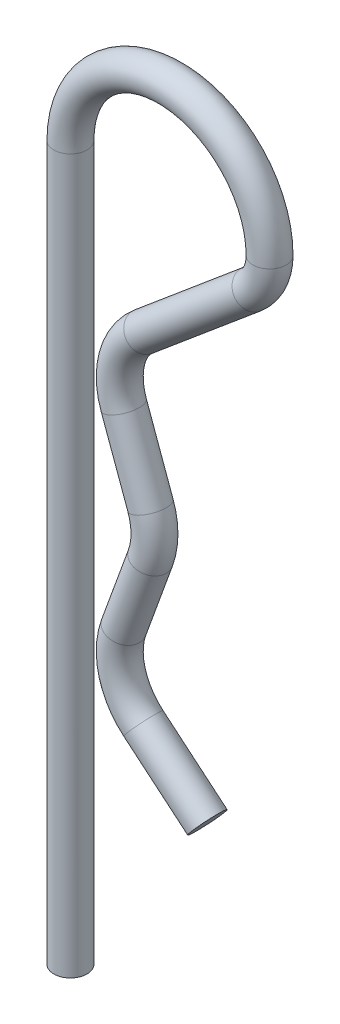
ISO-10303-21;
HEADER;
FILE_DESCRIPTION(('STEP AP214'),'2;1');
FILE_NAME('part.step','',(''),(''),'','','');
FILE_SCHEMA(('AUTOMOTIVE_DESIGN { 1 0 10303 214 1 1 1 1 }'));
ENDSEC;
DATA;
#1=APPLICATION_CONTEXT('core data for automotive mechanical design processes');
#2=APPLICATION_PROTOCOL_DEFINITION('international standard','automotive_design',2000,#1);
#3=PRODUCT_CONTEXT('',#1,'mechanical');
#4=PRODUCT('Part','Part','',(#3));
#5=PRODUCT_RELATED_PRODUCT_CATEGORY('part','',(#4));
#6=PRODUCT_DEFINITION_FORMATION('','',#4);
#7=PRODUCT_DEFINITION_CONTEXT('part definition',#1,'design');
#8=PRODUCT_DEFINITION('design','',#6,#7);
#9=PRODUCT_DEFINITION_SHAPE('','',#8);
#10=(LENGTH_UNIT() NAMED_UNIT(*) SI_UNIT(.MILLI.,.METRE.));
#11=(NAMED_UNIT(*) PLANE_ANGLE_UNIT() SI_UNIT($,.RADIAN.));
#12=(NAMED_UNIT(*) SI_UNIT($,.STERADIAN.) SOLID_ANGLE_UNIT());
#13=UNCERTAINTY_MEASURE_WITH_UNIT(LENGTH_MEASURE(1.E-05),#10,'distance_accuracy_value','');
#14=(GEOMETRIC_REPRESENTATION_CONTEXT(3) GLOBAL_UNCERTAINTY_ASSIGNED_CONTEXT((#13)) GLOBAL_UNIT_ASSIGNED_CONTEXT((#10,
#11,#12)) REPRESENTATION_CONTEXT('',''));
#15=CARTESIAN_POINT('',(0.,0.,0.));
#16=DIRECTION('',(0.,0.,1.));
#17=DIRECTION('',(1.,0.,0.));
#18=AXIS2_PLACEMENT_3D('',#15,#16,#17);
#19=CARTESIAN_POINT('',(0.,-25.,0.));
#20=DIRECTION('',(0.,-1.,0.));
#21=DIRECTION('',(0.,0.,-1.));
#22=AXIS2_PLACEMENT_3D('',#19,#20,#21);
#23=PLANE('',#22);
#24=CARTESIAN_POINT('',(0.,-25.,0.));
#25=DIRECTION('',(0.,1.,0.));
#26=DIRECTION('',(1.,0.,0.));
#27=AXIS2_PLACEMENT_3D('',#24,#25,#26);
#28=CIRCLE('',#27,1.);
#29=CARTESIAN_POINT('',(1.,-25.,0.));
#30=VERTEX_POINT('',#29);
#31=EDGE_CURVE('E21',#30,#30,#28,.T.);
#32=ORIENTED_EDGE('',*,*,#31,.F.);
#33=EDGE_LOOP('',(#32));
#34=FACE_BOUND('',#33,.T.);
#35=ADVANCED_FACE('F13',(#34),#23,.T.);
#36=CARTESIAN_POINT('',(0.,-25.,0.));
#37=DIRECTION('',(0.,1.,0.));
#38=DIRECTION('',(1.,0.,0.));
#39=AXIS2_PLACEMENT_3D('',#36,#37,#38);
#40=CYLINDRICAL_SURFACE('',#39,1.);
#41=CARTESIAN_POINT('',(0.,18.,0.));
#42=DIRECTION('',(0.,-1.,0.));
#43=DIRECTION('',(1.,0.,0.));
#44=AXIS2_PLACEMENT_3D('',#41,#42,#43);
#45=CIRCLE('',#44,1.);
#46=CARTESIAN_POINT('',(-1.,18.,0.));
#47=VERTEX_POINT('',#46);
#48=EDGE_CURVE('E9',#47,#47,#45,.T.);
#49=ORIENTED_EDGE('',*,*,#48,.T.);
#50=EDGE_LOOP('',(#49));
#51=FACE_BOUND('',#50,.T.);
#52=ORIENTED_EDGE('',*,*,#31,.T.);
#53=EDGE_LOOP('',(#52));
#54=FACE_BOUND('',#53,.T.);
#55=ADVANCED_FACE('F15',(#51,#54),#40,.T.);
#56=CARTESIAN_POINT('',(6.,18.,0.));
#57=DIRECTION('',(0.,0.,1.));
#58=DIRECTION('',(0.,1.,0.));
#59=AXIS2_PLACEMENT_3D('',#56,#57,#58);
#60=TOROIDAL_SURFACE('',#59,6.,1.);
#61=CARTESIAN_POINT('',(12.,18.,0.));
#62=DIRECTION('',(0.,1.,0.));
#63=DIRECTION('',(0.,0.,1.));
#64=AXIS2_PLACEMENT_3D('',#61,#62,#63);
#65=CIRCLE('',#64,1.);
#66=CARTESIAN_POINT('',(13.,18.,0.));
#67=VERTEX_POINT('',#66);
#68=EDGE_CURVE('E30',#67,#67,#65,.F.);
#69=CARTESIAN_POINT('',(6.,18.,0.));
#70=DIRECTION('',(0.,0.,1.));
#71=DIRECTION('',(0.,1.,0.));
#72=AXIS2_PLACEMENT_3D('',#69,#70,#71);
#73=CIRCLE('',#72,7.);
#74=EDGE_CURVE('',#67,#47,#73,.T.);
#75=ORIENTED_EDGE('',*,*,#68,.F.);
#76=ORIENTED_EDGE('',*,*,#48,.F.);
#77=ORIENTED_EDGE('',*,*,#74,.T.);
#78=ORIENTED_EDGE('',*,*,#74,.F.);
#79=EDGE_LOOP('',(#75,#77,#76,#78));
#80=FACE_BOUND('',#79,.T.);
#81=ADVANCED_FACE('F102',(#80),#60,.T.);
#82=CARTESIAN_POINT('',(9.,18.,0.));
#83=DIRECTION('',(0.,0.,1.));
#84=DIRECTION('',(0.,1.,0.));
#85=AXIS2_PLACEMENT_3D('',#82,#83,#84);
#86=TOROIDAL_SURFACE('',#85,3.,1.);
#87=CARTESIAN_POINT('',(10.9283628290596,15.701866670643,0.));
#88=DIRECTION('',(-0.766044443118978,-0.642787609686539,0.));
#89=DIRECTION('',(-0.642787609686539,0.766044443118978,0.));
#90=AXIS2_PLACEMENT_3D('',#87,#88,#89);
#91=CIRCLE('',#90,1.);
#92=CARTESIAN_POINT('',(11.5711504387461,14.9358222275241,0.));
#93=VERTEX_POINT('',#92);
#94=EDGE_CURVE('E37',#93,#93,#91,.T.);
#95=CARTESIAN_POINT('',(9.,18.,0.));
#96=DIRECTION('',(0.,0.,1.));
#97=DIRECTION('',(0.,1.,0.));
#98=AXIS2_PLACEMENT_3D('',#95,#96,#97);
#99=CIRCLE('',#98,4.);
#100=EDGE_CURVE('',#93,#67,#99,.T.);
#101=ORIENTED_EDGE('',*,*,#94,.F.);
#102=ORIENTED_EDGE('',*,*,#68,.T.);
#103=ORIENTED_EDGE('',*,*,#100,.T.);
#104=ORIENTED_EDGE('',*,*,#100,.F.);
#105=EDGE_LOOP('',(#101,#103,#102,#104));
#106=FACE_BOUND('',#105,.T.);
#107=ADVANCED_FACE('F106',(#106),#86,.T.);
#108=CARTESIAN_POINT('',(1.06417777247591,0.,0.));
#109=DIRECTION('',(0.,0.,1.));
#110=DIRECTION('',(0.,1.,0.));
#111=AXIS2_PLACEMENT_3D('',#108,#109,#110);
#112=TOROIDAL_SURFACE('',#111,4.,1.);
#113=CARTESIAN_POINT('',(4.82294825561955,-1.36808057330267,0.));
#114=DIRECTION('',(-0.342020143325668,-0.939692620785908,0.));
#115=DIRECTION('',(-0.939692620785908,0.342020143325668,0.));
#116=AXIS2_PLACEMENT_3D('',#113,#114,#115);
#117=CIRCLE('',#116,1.);
#118=CARTESIAN_POINT('',(5.76264087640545,-1.71010071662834,0.));
#119=VERTEX_POINT('',#118);
#120=EDGE_CURVE('E59',#119,#119,#117,.T.);
#121=CARTESIAN_POINT('',(4.82294825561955,1.36808057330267,0.));
#122=DIRECTION('',(-0.342020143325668,0.939692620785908,0.));
#123=DIRECTION('',(-0.939692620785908,-0.342020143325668,0.));
#124=AXIS2_PLACEMENT_3D('',#121,#122,#123);
#125=CIRCLE('',#124,1.);
#126=CARTESIAN_POINT('',(5.76264087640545,1.71010071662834,0.));
#127=VERTEX_POINT('',#126);
#128=EDGE_CURVE('E47',#127,#127,#125,.T.);
#129=CARTESIAN_POINT('',(1.06417777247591,0.,0.));
#130=DIRECTION('',(0.,0.,1.));
#131=DIRECTION('',(0.,1.,0.));
#132=AXIS2_PLACEMENT_3D('',#129,#130,#131);
#133=CIRCLE('',#132,5.);
#134=EDGE_CURVE('',#119,#127,#133,.T.);
#135=ORIENTED_EDGE('',*,*,#120,.F.);
#136=ORIENTED_EDGE('',*,*,#128,.F.);
#137=ORIENTED_EDGE('',*,*,#134,.T.);
#138=ORIENTED_EDGE('',*,*,#134,.F.);
#139=EDGE_LOOP('',(#135,#137,#136,#138));
#140=FACE_BOUND('',#139,.T.);
#141=ADVANCED_FACE('F110',(#140),#112,.T.);
#142=CARTESIAN_POINT('',(10.9283628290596,15.701866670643,0.));
#143=DIRECTION('',(-0.766044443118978,-0.642787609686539,0.));
#144=DIRECTION('',(-0.642787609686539,0.766044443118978,0.));
#145=AXIS2_PLACEMENT_3D('',#142,#143,#144);
#146=CYLINDRICAL_SURFACE('',#145,1.);
#147=CARTESIAN_POINT('',(4.40039567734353,10.2242518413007,0.));
#148=DIRECTION('',(0.766044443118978,0.642787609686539,0.));
#149=DIRECTION('',(0.,0.,-1.));
#150=AXIS2_PLACEMENT_3D('',#147,#148,#149);
#151=CIRCLE('',#150,1.);
#152=CARTESIAN_POINT('',(3.75760806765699,10.9902962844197,0.));
#153=VERTEX_POINT('',#152);
#154=EDGE_CURVE('E43',#153,#153,#151,.F.);
#155=ORIENTED_EDGE('',*,*,#154,.F.);
#156=EDGE_LOOP('',(#155));
#157=FACE_BOUND('',#156,.T.);
#158=ORIENTED_EDGE('',*,*,#94,.T.);
#159=EDGE_LOOP('',(#158));
#160=FACE_BOUND('',#159,.T.);
#161=ADVANCED_FACE('F114',(#157,#160),#146,.T.);
#162=CARTESIAN_POINT('',(6.97154611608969,7.16007406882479,0.));
#163=DIRECTION('',(0.,0.,-1.));
#164=DIRECTION('',(0.766044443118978,0.642787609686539,0.));
#165=AXIS2_PLACEMENT_3D('',#162,#163,#164);
#166=TOROIDAL_SURFACE('',#165,4.,1.);
#167=CARTESIAN_POINT('',(3.21277563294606,5.79199349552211,0.));
#168=DIRECTION('',(0.342020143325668,-0.939692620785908,0.));
#169=DIRECTION('',(-0.939692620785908,-0.342020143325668,0.));
#170=AXIS2_PLACEMENT_3D('',#167,#168,#169);
#171=CIRCLE('',#170,1.);
#172=CARTESIAN_POINT('',(2.27308301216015,5.44997335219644,0.));
#173=VERTEX_POINT('',#172);
#174=EDGE_CURVE('E51',#173,#173,#171,.T.);
#175=CARTESIAN_POINT('',(6.97154611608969,7.16007406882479,0.));
#176=DIRECTION('',(0.,0.,-1.));
#177=DIRECTION('',(0.766044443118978,0.642787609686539,0.));
#178=AXIS2_PLACEMENT_3D('',#175,#176,#177);
#179=CIRCLE('',#178,5.);
#180=EDGE_CURVE('',#173,#153,#179,.T.);
#181=ORIENTED_EDGE('',*,*,#174,.F.);
#182=ORIENTED_EDGE('',*,*,#154,.T.);
#183=ORIENTED_EDGE('',*,*,#180,.T.);
#184=ORIENTED_EDGE('',*,*,#180,.F.);
#185=EDGE_LOOP('',(#181,#183,#182,#184));
#186=FACE_BOUND('',#185,.T.);
#187=ADVANCED_FACE('F118',(#186),#166,.T.);
#188=CARTESIAN_POINT('',(3.21277563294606,5.79199349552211,0.));
#189=DIRECTION('',(0.342020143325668,-0.939692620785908,0.));
#190=DIRECTION('',(-0.939692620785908,-0.342020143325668,0.));
#191=AXIS2_PLACEMENT_3D('',#188,#189,#190);
#192=CYLINDRICAL_SURFACE('',#191,1.);
#193=ORIENTED_EDGE('',*,*,#128,.T.);
#194=EDGE_LOOP('',(#193));
#195=FACE_BOUND('',#194,.T.);
#196=ORIENTED_EDGE('',*,*,#174,.T.);
#197=EDGE_LOOP('',(#196));
#198=FACE_BOUND('',#197,.T.);
#199=ADVANCED_FACE('F80',(#195,#198),#192,.T.);
#200=CARTESIAN_POINT('',(10.9283628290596,-15.701866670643,0.));
#201=DIRECTION('',(-0.766044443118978,0.642787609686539,0.));
#202=DIRECTION('',(-0.642787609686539,-0.766044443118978,0.));
#203=AXIS2_PLACEMENT_3D('',#200,#201,#202);
#204=CYLINDRICAL_SURFACE('',#203,1.);
#205=CARTESIAN_POINT('',(8.2526524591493,-13.4566790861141,0.));
#206=DIRECTION('',(0.766044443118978,-0.642787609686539,0.));
#207=DIRECTION('',(0.642787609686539,0.766044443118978,0.));
#208=AXIS2_PLACEMENT_3D('',#205,#206,#207);
#209=CIRCLE('',#208,1.);
#210=CARTESIAN_POINT('',(7.60986484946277,-14.2227235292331,0.));
#211=VERTEX_POINT('',#210);
#212=EDGE_CURVE('E67',#211,#211,#209,.T.);
#213=CARTESIAN_POINT('',(4.40039567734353,-10.2242518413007,0.));
#214=DIRECTION('',(0.766044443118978,-0.642787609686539,0.));
#215=DIRECTION('',(0.,0.,1.));
#216=AXIS2_PLACEMENT_3D('',#213,#214,#215);
#217=CIRCLE('',#216,1.);
#218=CARTESIAN_POINT('',(3.757608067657,-10.9902962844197,0.));
#219=VERTEX_POINT('',#218);
#220=EDGE_CURVE('E55',#219,#219,#217,.F.);
#221=CARTESIAN_POINT('',(7.60986484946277,-14.2227235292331,0.));
#222=CARTESIAN_POINT('',(7.56973717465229,-14.1890524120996,0.));
#223=CARTESIAN_POINT('',(7.52960949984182,-14.1553812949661,0.));
#224=CARTESIAN_POINT('',(7.44935415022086,-14.0880390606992,0.));
#225=CARTESIAN_POINT('',(7.40922647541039,-14.0543679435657,0.));
#226=CARTESIAN_POINT('',(7.32897112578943,-13.9870257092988,0.));
#227=CARTESIAN_POINT('',(7.28884345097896,-13.9533545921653,0.));
#228=CARTESIAN_POINT('',(7.208588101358,-13.8860123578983,0.));
#229=CARTESIAN_POINT('',(7.16846042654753,-13.8523412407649,0.));
#230=CARTESIAN_POINT('',(7.08820507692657,-13.7849990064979,0.));
#231=CARTESIAN_POINT('',(7.0480774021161,-13.7513278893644,0.));
#232=CARTESIAN_POINT('',(6.96782205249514,-13.6839856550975,0.));
#233=CARTESIAN_POINT('',(6.92769437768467,-13.650314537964,0.));
#234=CARTESIAN_POINT('',(6.84743902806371,-13.5829723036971,0.));
#235=CARTESIAN_POINT('',(6.80731135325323,-13.5493011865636,0.));
#236=CARTESIAN_POINT('',(6.72705600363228,-13.4819589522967,0.));
#237=CARTESIAN_POINT('',(6.6869283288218,-13.4482878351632,0.));
#238=CARTESIAN_POINT('',(6.60667297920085,-13.3809456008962,0.));
#239=CARTESIAN_POINT('',(6.56654530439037,-13.3472744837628,0.));
#240=CARTESIAN_POINT('',(6.48628995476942,-13.2799322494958,0.));
#241=CARTESIAN_POINT('',(6.44616227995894,-13.2462611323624,0.));
#242=CARTESIAN_POINT('',(6.36590693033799,-13.1789188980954,0.));
#243=CARTESIAN_POINT('',(6.32577925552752,-13.1452477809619,0.));
#244=CARTESIAN_POINT('',(6.24552390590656,-13.077905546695,0.));
#245=CARTESIAN_POINT('',(6.20539623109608,-13.0442344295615,0.));
#246=CARTESIAN_POINT('',(6.12514088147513,-12.9768921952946,0.));
#247=CARTESIAN_POINT('',(6.08501320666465,-12.9432210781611,0.));
#248=CARTESIAN_POINT('',(6.0047578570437,-12.8758788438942,0.));
#249=CARTESIAN_POINT('',(5.96463018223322,-12.8422077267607,0.));
#250=CARTESIAN_POINT('',(5.88437483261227,-12.7748654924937,0.));
#251=CARTESIAN_POINT('',(5.84424715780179,-12.7411943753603,0.));
#252=CARTESIAN_POINT('',(5.76399180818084,-12.6738521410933,0.));
#253=CARTESIAN_POINT('',(5.72386413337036,-12.6401810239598,0.));
#254=CARTESIAN_POINT('',(5.64360878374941,-12.5728387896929,0.));
#255=CARTESIAN_POINT('',(5.60348110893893,-12.5391676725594,0.));
#256=CARTESIAN_POINT('',(5.52322575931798,-12.4718254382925,0.));
#257=CARTESIAN_POINT('',(5.4830980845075,-12.438154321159,0.));
#258=CARTESIAN_POINT('',(5.40284273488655,-12.3708120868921,0.));
#259=CARTESIAN_POINT('',(5.36271506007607,-12.3371409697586,0.));
#260=CARTESIAN_POINT('',(5.28245971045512,-12.2697987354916,0.));
#261=CARTESIAN_POINT('',(5.24233203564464,-12.2361276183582,0.));
#262=CARTESIAN_POINT('',(5.16207668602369,-12.1687853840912,0.));
#263=CARTESIAN_POINT('',(5.12194901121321,-12.1351142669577,0.));
#264=CARTESIAN_POINT('',(5.04169366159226,-12.0677720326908,0.));
#265=CARTESIAN_POINT('',(5.00156598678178,-12.0341009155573,0.));
#266=CARTESIAN_POINT('',(4.92131063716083,-11.9667586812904,0.));
#267=CARTESIAN_POINT('',(4.88118296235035,-11.9330875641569,0.));
#268=CARTESIAN_POINT('',(4.8009276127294,-11.86574532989,0.));
#269=CARTESIAN_POINT('',(4.76079993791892,-11.8320742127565,0.));
#270=CARTESIAN_POINT('',(4.68054458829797,-11.7647319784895,0.));
#271=CARTESIAN_POINT('',(4.64041691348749,-11.7310608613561,0.));
#272=CARTESIAN_POINT('',(4.56016156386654,-11.6637186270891,0.));
#273=CARTESIAN_POINT('',(4.52003388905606,-11.6300475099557,0.));
#274=CARTESIAN_POINT('',(4.43977853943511,-11.5627052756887,0.));
#275=CARTESIAN_POINT('',(4.39965086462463,-11.5290341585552,0.));
#276=CARTESIAN_POINT('',(4.31939551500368,-11.4616919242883,0.));
#277=CARTESIAN_POINT('',(4.2792678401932,-11.4280208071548,0.));
#278=CARTESIAN_POINT('',(4.19901249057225,-11.3606785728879,0.));
#279=CARTESIAN_POINT('',(4.15888481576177,-11.3270074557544,0.));
#280=CARTESIAN_POINT('',(4.07862946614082,-11.2596652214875,0.));
#281=CARTESIAN_POINT('',(4.03850179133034,-11.225994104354,0.));
#282=CARTESIAN_POINT('',(3.95824644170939,-11.158651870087,0.));
#283=CARTESIAN_POINT('',(3.91811876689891,-11.1249807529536,0.));
#284=CARTESIAN_POINT('',(3.83786341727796,-11.0576385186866,0.));
#285=CARTESIAN_POINT('',(3.79773574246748,-11.0239674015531,0.));
#286=CARTESIAN_POINT('',(3.757608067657,-10.9902962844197,0.));
#287=B_SPLINE_CURVE_WITH_KNOTS('',3,(#221,#222,#223,#224,#225,#226,#227,#228,#229,#230,#231,
#232,#233,#234,#235,#236,#237,#238,#239,#240,#241,#242,#243,#244,#245,#246,#247,#248,#249,#250,
#251,#252,#253,#254,#255,#256,#257,#258,#259,#260,#261,#262,#263,#264,#265,#266,#267,#268,#269,
#270,#271,#272,#273,#274,#275,#276,#277,#278,#279,#280,#281,#282,#283,#284,#285,#286),
.UNSPECIFIED.,.F.,.F.,(4,2,2,2,2,2,2,2,2,2,2,2,2,2,2,2,2,2,2,2,2,2,2,2,2,2,2,2,2,2,2,2,4),(0.,
0.157148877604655,0.31429775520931,0.471446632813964,0.628595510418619,0.785744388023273,
0.942893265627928,1.10004214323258,1.25719102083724,1.41433989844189,1.57148877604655,
1.7286376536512,1.88578653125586,2.04293540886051,2.20008428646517,2.35723316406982,
2.51438204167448,2.67153091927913,2.82867979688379,2.98582867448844,3.1429775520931,
3.30012642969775,3.4572753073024,3.61442418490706,3.77157306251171,3.92872194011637,
4.08587081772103,4.24301969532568,4.40016857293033,4.55731745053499,4.71446632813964,
4.8716152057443,5.02876408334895),.UNSPECIFIED.);
#288=EDGE_CURVE('BSEAM76',#211,#219,#287,.T.);
#289=ORIENTED_EDGE('',*,*,#212,.F.);
#290=ORIENTED_EDGE('',*,*,#220,.F.);
#291=ORIENTED_EDGE('',*,*,#288,.T.);
#292=ORIENTED_EDGE('',*,*,#288,.F.);
#293=EDGE_LOOP('',(#289,#291,#290,#292));
#294=FACE_BOUND('',#293,.T.);
#295=ADVANCED_FACE('F76',(#294),#204,.T.);
#296=CARTESIAN_POINT('',(6.97154611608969,-7.16007406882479,0.));
#297=DIRECTION('',(0.,0.,1.));
#298=DIRECTION('',(0.766044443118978,-0.642787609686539,0.));
#299=AXIS2_PLACEMENT_3D('',#296,#297,#298);
#300=TOROIDAL_SURFACE('',#299,4.,1.);
#301=CARTESIAN_POINT('',(3.21277563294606,-5.79199349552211,0.));
#302=DIRECTION('',(0.342020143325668,0.939692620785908,0.));
#303=DIRECTION('',(-0.939692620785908,0.342020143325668,0.));
#304=AXIS2_PLACEMENT_3D('',#301,#302,#303);
#305=CIRCLE('',#304,1.);
#306=CARTESIAN_POINT('',(2.27308301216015,-5.44997335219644,0.));
#307=VERTEX_POINT('',#306);
#308=EDGE_CURVE('E63',#307,#307,#305,.T.);
#309=CARTESIAN_POINT('',(6.97154611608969,-7.16007406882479,0.));
#310=DIRECTION('',(0.,0.,1.));
#311=DIRECTION('',(0.766044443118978,-0.642787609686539,0.));
#312=AXIS2_PLACEMENT_3D('',#309,#310,#311);
#313=CIRCLE('',#312,5.);
#314=EDGE_CURVE('',#307,#219,#313,.T.);
#315=ORIENTED_EDGE('',*,*,#308,.F.);
#316=ORIENTED_EDGE('',*,*,#220,.T.);
#317=ORIENTED_EDGE('',*,*,#314,.T.);
#318=ORIENTED_EDGE('',*,*,#314,.F.);
#319=EDGE_LOOP('',(#315,#317,#316,#318));
#320=FACE_BOUND('',#319,.T.);
#321=ADVANCED_FACE('F79',(#320),#300,.T.);
#322=CARTESIAN_POINT('',(3.21277563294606,-5.79199349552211,0.));
#323=DIRECTION('',(0.342020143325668,0.939692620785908,0.));
#324=DIRECTION('',(-0.939692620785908,0.342020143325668,0.));
#325=AXIS2_PLACEMENT_3D('',#322,#323,#324);
#326=CYLINDRICAL_SURFACE('',#325,1.);
#327=ORIENTED_EDGE('',*,*,#120,.T.);
#328=EDGE_LOOP('',(#327));
#329=FACE_BOUND('',#328,.T.);
#330=ORIENTED_EDGE('',*,*,#308,.T.);
#331=EDGE_LOOP('',(#330));
#332=FACE_BOUND('',#331,.T.);
#333=ADVANCED_FACE('F85',(#329,#332),#326,.T.);
#334=CARTESIAN_POINT('',(8.2526524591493,-13.4566790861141,0.));
#335=DIRECTION('',(-0.766044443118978,0.642787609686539,0.));
#336=DIRECTION('',(0.,0.,1.));
#337=AXIS2_PLACEMENT_3D('',#334,#335,#336);
#338=PLANE('',#337);
#339=ORIENTED_EDGE('',*,*,#212,.T.);
#340=EDGE_LOOP('',(#339));
#341=FACE_BOUND('',#340,.T.);
#342=ADVANCED_FACE('F74',(#341),#338,.F.);
#343=CLOSED_SHELL('',(#35,#55,#81,#107,#141,#161,#187,#199,#295,#321,#333,#342));
#344=MANIFOLD_SOLID_BREP('B1',#343);
#345=ADVANCED_BREP_SHAPE_REPRESENTATION('',(#18,#344),#14);
#346=SHAPE_DEFINITION_REPRESENTATION(#9,#345);
ENDSEC;
END-ISO-10303-21;
